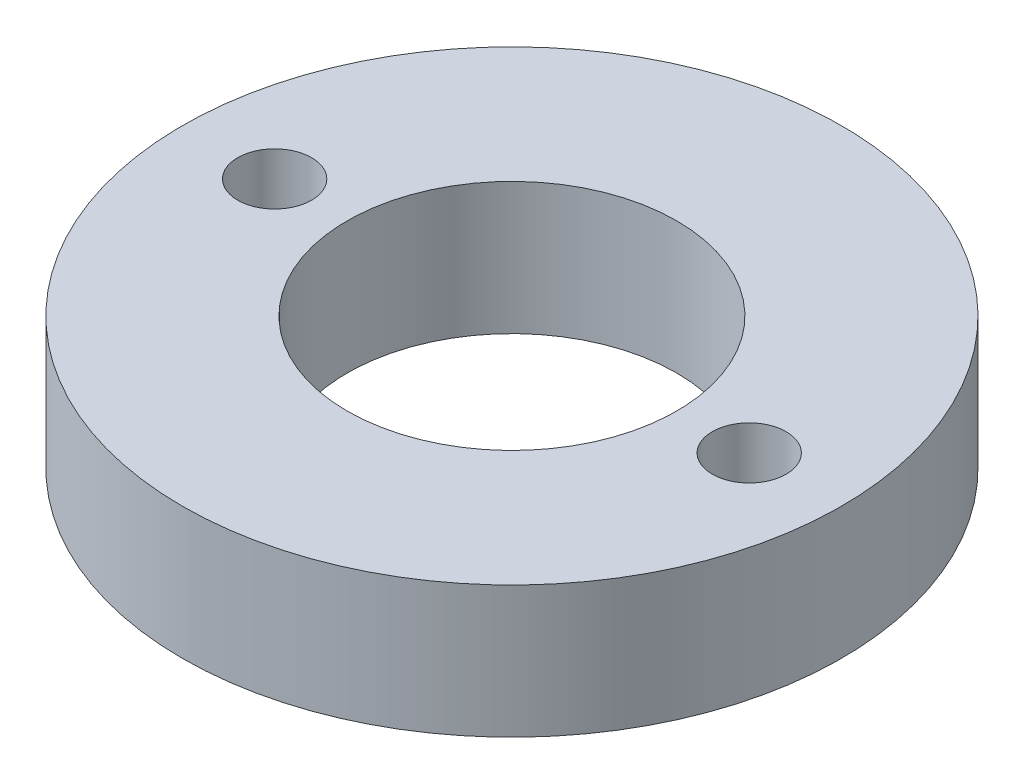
from build123d import *

# Parameters (mm, degrees)
SKETCH1_R           = 15.875
SKETCH1_R_2         = 7.9375
SKETCH1_R_3         = 1.778
BOSS_EXTRUDE1_DEPTH = 6.35


with BuildPart() as part:
    # Sketch1 → Boss-Extrude1 (new body)
    with BuildSketch(Plane(origin=(0, 0, 0), x_dir=(1, 0, 0), z_dir=(0, 1, 0))):
        with Locations(Location((0, 0, 0), (0, 0, 270))):
            Circle(SKETCH1_R)
        with Locations(Location((0, 0, 0), (0, 0, 270))):
            Circle(SKETCH1_R_2, mode=Mode.SUBTRACT)
        with Locations(Location((-11.43, 0, 0), (0, 0, 270))):
            Circle(SKETCH1_R_3, mode=Mode.SUBTRACT)
        with Locations(Location((11.43, 0, 0), (0, 0, 270))):
            Circle(SKETCH1_R_3, mode=Mode.SUBTRACT)
    extrude(amount=BOSS_EXTRUDE1_DEPTH)


solid = part.part
